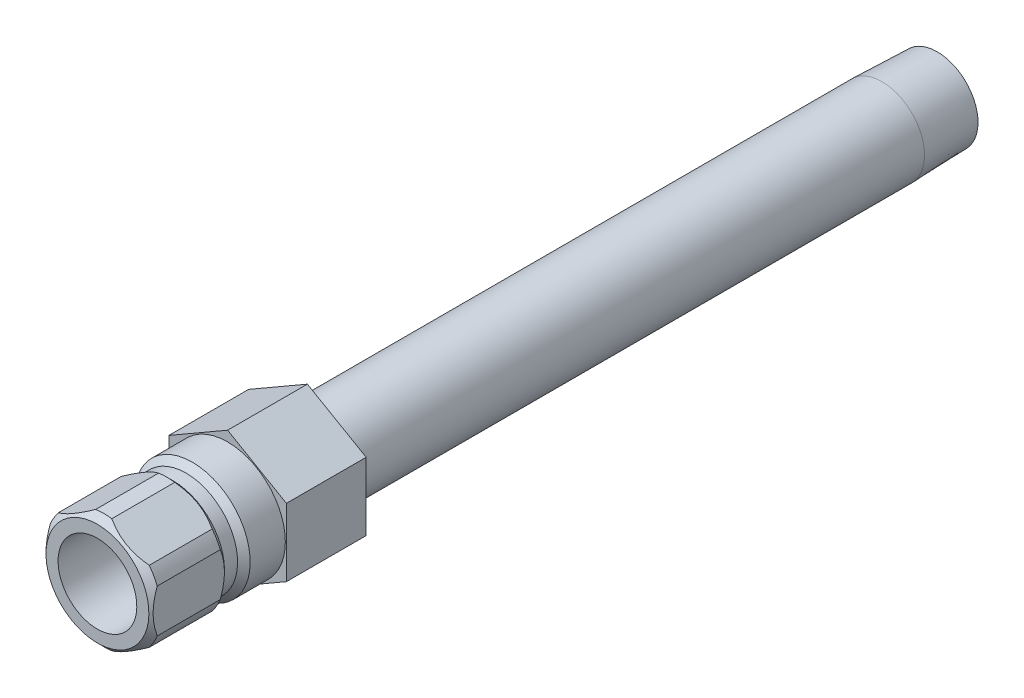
from build123d import *

# Parameters (mm, degrees)
SKETCH2_R           = 4.7625
BOSS_EXTRUDE1_DEPTH = 9.652
CUT_EXTRUDE1_START  = 6.604
SKETCH3_OUTSIDE_W   = 37.004
SKETCH3_OUTSIDE_H   = 39.204
CUT_EXTRUDE1_DEPTH  = 80.932623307


with BuildPart() as part:
    # Sketch1 → Revolve1 (revolve)
    with BuildSketch(Plane(origin=(0, 0, 0), x_dir=(0, 0, -1), z_dir=(1, 0, 0))):
        Polygon((-15.748, 4.7625), (-15.748, 6.223), (-14.986, 6.985), (-7.366, 6.985), (-6.604, 6.223), (-5.0165, 6.223), (-4.2545, 6.985), (9.652, 6.985), (9.652, 5.1435), (79.1718, 5.1435), (85.852, 4.934744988), (85.852, 3.4163), (-2.840212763, 3.4163), (-3.556, 4.7625), align=None)
    revolve(axis=Axis((0, 0, -9.652), (0, 0, 1)))

    # Sketch2 → Boss-Extrude1 (add)
    with BuildSketch(Plane.XY):
        Polygon((-7.112, 4.106115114), (-7.112, -4.106115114), (0, -8.212230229), (7.112, -4.106115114), (7.112, 4.106115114), (0, 8.212230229), align=None)
        with Locations(Location((0, 0, 0), (0, 0, 90))):
            Circle(SKETCH2_R, mode=Mode.SUBTRACT)
    extrude(amount=-BOSS_EXTRUDE1_DEPTH)

    # Sketch3 outside → Cut-Extrude1 (cut, through all)
    with BuildSketch(Plane.XY.offset(CUT_EXTRUDE1_START)):
        Rectangle(SKETCH3_OUTSIDE_W, SKETCH3_OUTSIDE_H)
        Polygon((6.477, 3.739497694), (0, 7.478995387), (-6.477, 3.739497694), (-6.477, -3.739497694), (0, -7.478995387), (6.477, -3.739497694), align=None, mode=Mode.SUBTRACT)
    extrude(amount=CUT_EXTRUDE1_DEPTH, mode=Mode.SUBTRACT)


solid = part.part
